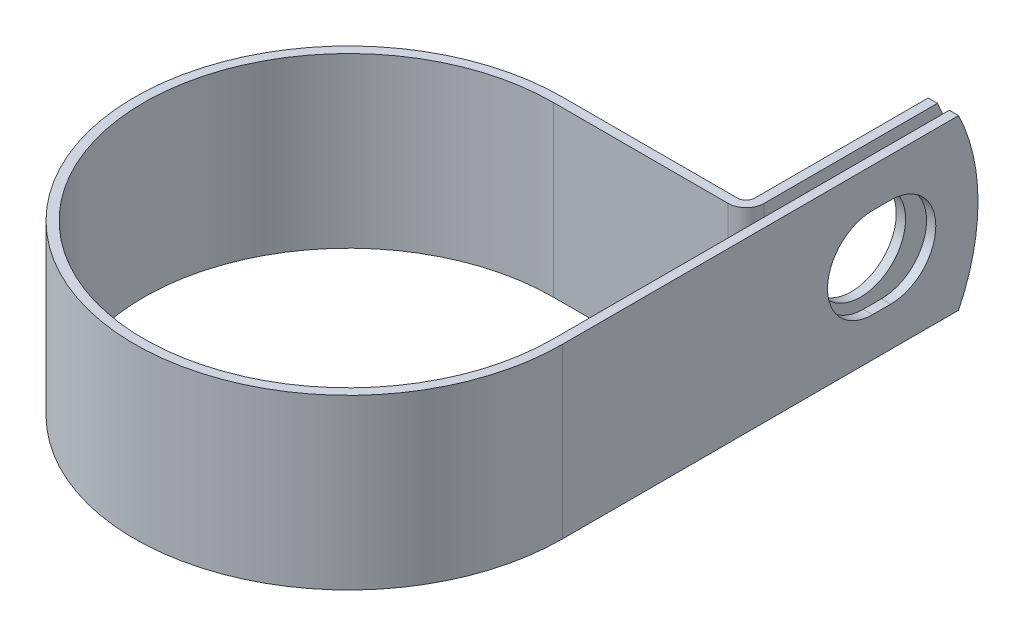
from build123d import *

# Parameters (mm, degrees)
EXTRUDE_THIN1_DEPTH = 11.1125
SKETCH2_R           = 5.9436
CUT_EXTRUDE1_DEPTH  = 1.2192
CUT_EXTRUDE2_REACH  = 81.403
CUT_EXTRUDE3_DEPTH  = 77.604106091


with BuildPart() as part:
    # Sketch1 → Extrude-Thin1 (new, symmetric)
    with BuildSketch(Plane(origin=(0, 0, 0), x_dir=(1, 0, 0), z_dir=(0, 1, 0))):
        with BuildLine():
            Line((26.9875, 54.7624), (26.9875, 26.9875))
            Line((26.9875, 26.9875), (26.9875, 0))
            ThreePointArc((26.9875, 0), (-19.083044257, -19.083044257), (0, 26.9875))
            Line((0, 26.9875), (23.03526, 26.9875))
            ThreePointArc((23.03526, 26.9875), (24.716363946, 27.683836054), (25.4127, 29.36494))
            Line((25.4127, 29.36494), (25.4127, 54.7624))
            Line((25.4127, 54.7624), (24.1935, 54.7624))
            Line((24.1935, 54.7624), (24.1935, 29.36494))
            ThreePointArc((24.1935, 29.36494), (23.854259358, 28.545940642), (23.03526, 28.2067))
            Line((23.03526, 28.2067), (0, 28.2067))
            ThreePointArc((0, 28.2067), (-19.945148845, -19.945148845), (28.2067, 0))
            Line((28.2067, 0), (28.2067, 26.9875))
            Line((28.2067, 26.9875), (28.2067, 54.7624))
            Line((28.2067, 54.7624), (26.9875, 54.7624))
        make_face()
    extrude(amount=EXTRUDE_THIN1_DEPTH, both=True)

    # Sketch2 → Cut-Extrude1 (cut)
    with BuildSketch(Plane.ZY.offset(-24.1935)):
        with Locations((-42.0624, 0)):
            Circle(SKETCH2_R)
    extrude(amount=-CUT_EXTRUDE1_DEPTH, mode=Mode.SUBTRACT)

    # Sketch3 → Cut-Extrude2 (cut, up to next)
    with BuildSketch(Plane(origin=(28.2067, 0, 0), x_dir=(0, 0, -1), z_dir=(1, 0, 0)), mode=Mode.PRIVATE) as cut_extrude2_sk1:
        with BuildLine():
            Line((40.8686, 5.9436), (43.2562, 5.9436))
            ThreePointArc((43.2562, 5.9436), (49.1998, 0), (43.2562, -5.9436))
            Line((43.2562, -5.9436), (40.8686, -5.9436))
            ThreePointArc((40.8686, -5.9436), (34.925, 0), (40.8686, 5.9436))
        make_face()
    cut_extrude2_tool1 = extrude(cut_extrude2_sk1.sketch, amount=-CUT_EXTRUDE2_REACH, mode=Mode.PRIVATE) & part.part
    add(cut_extrude2_tool1.solids().sort_by_distance((28.2067, 0, -42.0624))[0], mode=Mode.SUBTRACT)

    # Sketch4 → Cut-Extrude3 (cut, through all)
    with BuildSketch(Plane.ZY.offset(-24.1935)):
        with BuildLine():
            Line((-52.20254763, 11.1125), (-54.7624, 11.1125))
            Line((-54.7624, 11.1125), (-54.7624, 0))
            ThreePointArc((-54.7624, 0), (-54.114165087, 5.701765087), (-52.20254763, 11.1125))
        make_face()
        with BuildLine():
            ThreePointArc((-52.20254763, -11.1125), (-54.114165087, -5.701765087), (-54.7624, 0))
            Line((-54.7624, 0), (-54.7624, -11.1125))
            Line((-54.7624, -11.1125), (-52.20254763, -11.1125))
        make_face()
    extrude(amount=-CUT_EXTRUDE3_DEPTH, mode=Mode.SUBTRACT)


solid = part.part
